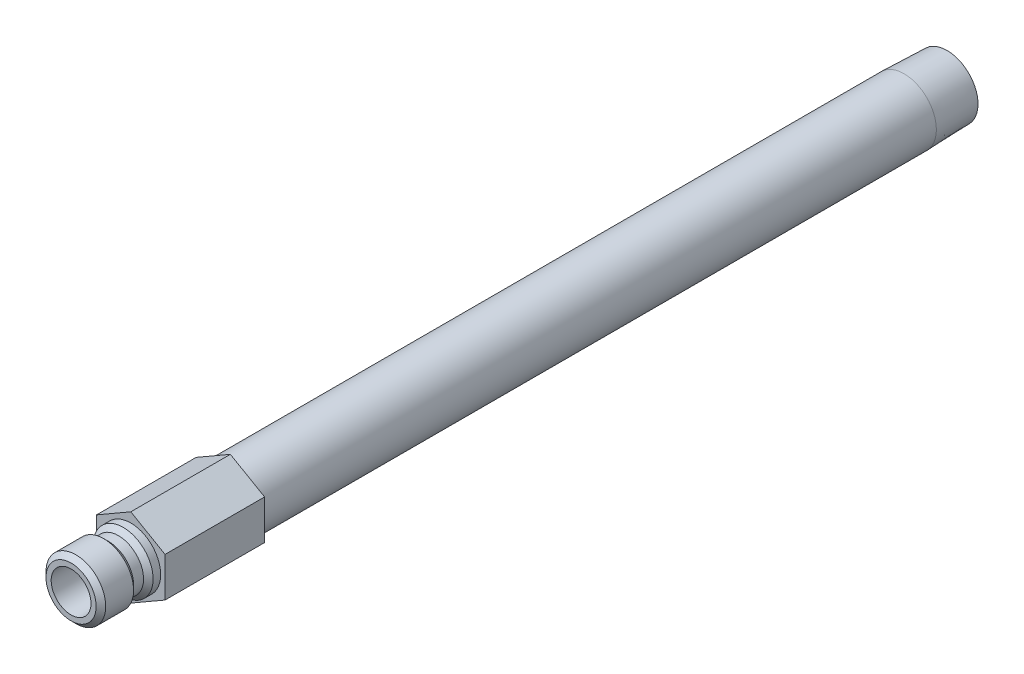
ISO-10303-21;
HEADER;
FILE_DESCRIPTION(('STEP AP214'),'2;1');
FILE_NAME('part.step','',(''),(''),'','','');
FILE_SCHEMA(('AUTOMOTIVE_DESIGN { 1 0 10303 214 1 1 1 1 }'));
ENDSEC;
DATA;
#1=APPLICATION_CONTEXT('core data for automotive mechanical design processes');
#2=APPLICATION_PROTOCOL_DEFINITION('international standard','automotive_design',2000,#1);
#3=PRODUCT_CONTEXT('',#1,'mechanical');
#4=PRODUCT('Part','Part','',(#3));
#5=PRODUCT_RELATED_PRODUCT_CATEGORY('part','',(#4));
#6=PRODUCT_DEFINITION_FORMATION('','',#4);
#7=PRODUCT_DEFINITION_CONTEXT('part definition',#1,'design');
#8=PRODUCT_DEFINITION('design','',#6,#7);
#9=PRODUCT_DEFINITION_SHAPE('','',#8);
#10=(LENGTH_UNIT() NAMED_UNIT(*) SI_UNIT(.MILLI.,.METRE.));
#11=(NAMED_UNIT(*) PLANE_ANGLE_UNIT() SI_UNIT($,.RADIAN.));
#12=(NAMED_UNIT(*) SI_UNIT($,.STERADIAN.) SOLID_ANGLE_UNIT());
#13=UNCERTAINTY_MEASURE_WITH_UNIT(LENGTH_MEASURE(1.E-05),#10,'distance_accuracy_value','');
#14=(GEOMETRIC_REPRESENTATION_CONTEXT(3) GLOBAL_UNCERTAINTY_ASSIGNED_CONTEXT((#13)) GLOBAL_UNIT_ASSIGNED_CONTEXT((#10,
#11,#12)) REPRESENTATION_CONTEXT('',''));
#15=CARTESIAN_POINT('',(0.,0.,0.));
#16=DIRECTION('',(0.,0.,1.));
#17=DIRECTION('',(1.,0.,0.));
#18=AXIS2_PLACEMENT_3D('',#15,#16,#17);
#19=CARTESIAN_POINT('',(0.,4.7625,0.));
#20=DIRECTION('',(0.,0.,1.));
#21=DIRECTION('',(0.,-1.,0.));
#22=AXIS2_PLACEMENT_3D('',#19,#20,#21);
#23=PLANE('',#22);
#24=CARTESIAN_POINT('',(0.,0.,0.));
#25=DIRECTION('',(0.,0.,-1.));
#26=DIRECTION('',(0.,1.,0.));
#27=AXIS2_PLACEMENT_3D('',#24,#25,#26);
#28=CIRCLE('',#27,4.7625);
#29=CARTESIAN_POINT('',(0.,4.7625,0.));
#30=VERTEX_POINT('',#29);
#31=EDGE_CURVE('E166',#30,#30,#28,.T.);
#32=ORIENTED_EDGE('',*,*,#31,.T.);
#33=EDGE_LOOP('',(#32));
#34=FACE_BOUND('',#33,.T.);
#35=DIRECTION('',(-0.866025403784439,-0.5,0.));
#36=VECTOR('',#35,1.);
#37=CARTESIAN_POINT('',(0.,6.3058196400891,0.));
#38=LINE('',#37,#36);
#39=CARTESIAN_POINT('',(0.,6.3058196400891,0.));
#40=VERTEX_POINT('',#39);
#41=CARTESIAN_POINT('',(-5.461,3.15290982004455,0.));
#42=VERTEX_POINT('',#41);
#43=EDGE_CURVE('E122',#40,#42,#38,.T.);
#44=ORIENTED_EDGE('',*,*,#43,.T.);
#45=DIRECTION('',(0.,-1.,0.));
#46=VECTOR('',#45,1.);
#47=CARTESIAN_POINT('',(-5.461,3.15290982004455,0.));
#48=LINE('',#47,#46);
#49=CARTESIAN_POINT('',(-5.461,-3.15290982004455,0.));
#50=VERTEX_POINT('',#49);
#51=EDGE_CURVE('E125',#42,#50,#48,.T.);
#52=ORIENTED_EDGE('',*,*,#51,.T.);
#53=DIRECTION('',(0.866025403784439,-0.5,0.));
#54=VECTOR('',#53,1.);
#55=CARTESIAN_POINT('',(-5.461,-3.15290982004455,0.));
#56=LINE('',#55,#54);
#57=CARTESIAN_POINT('',(0.,-6.30581964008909,0.));
#58=VERTEX_POINT('',#57);
#59=EDGE_CURVE('E129',#50,#58,#56,.T.);
#60=ORIENTED_EDGE('',*,*,#59,.T.);
#61=DIRECTION('',(0.866025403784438,0.5,0.));
#62=VECTOR('',#61,1.);
#63=CARTESIAN_POINT('',(0.,-6.30581964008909,0.));
#64=LINE('',#63,#62);
#65=CARTESIAN_POINT('',(5.461,-3.15290982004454,0.));
#66=VERTEX_POINT('',#65);
#67=EDGE_CURVE('E132',#58,#66,#64,.T.);
#68=ORIENTED_EDGE('',*,*,#67,.T.);
#69=DIRECTION('',(0.,1.,0.));
#70=VECTOR('',#69,1.);
#71=CARTESIAN_POINT('',(5.461,-3.15290982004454,0.));
#72=LINE('',#71,#70);
#73=CARTESIAN_POINT('',(5.461,3.15290982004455,0.));
#74=VERTEX_POINT('',#73);
#75=EDGE_CURVE('E99',#66,#74,#72,.T.);
#76=ORIENTED_EDGE('',*,*,#75,.T.);
#77=DIRECTION('',(-0.866025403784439,0.5,0.));
#78=VECTOR('',#77,1.);
#79=CARTESIAN_POINT('',(5.461,3.15290982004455,0.));
#80=LINE('',#79,#78);
#81=EDGE_CURVE('E135',#74,#40,#80,.T.);
#82=ORIENTED_EDGE('',*,*,#81,.T.);
#83=EDGE_LOOP('',(#44,#52,#60,#68,#76,#82));
#84=FACE_BOUND('',#83,.T.);
#85=ADVANCED_FACE('F33',(#34,#84),#23,.T.);
#86=CARTESIAN_POINT('',(0.,0.,0.));
#87=DIRECTION('',(0.,0.,-1.));
#88=DIRECTION('',(0.,1.,0.));
#89=AXIS2_PLACEMENT_3D('',#86,#87,#88);
#90=CYLINDRICAL_SURFACE('',#89,4.7625);
#91=CARTESIAN_POINT('',(0.,0.,1.2065));
#92=DIRECTION('',(0.,0.,-1.));
#93=DIRECTION('',(0.,1.,0.));
#94=AXIS2_PLACEMENT_3D('',#91,#92,#93);
#95=CIRCLE('',#94,4.7625);
#96=CARTESIAN_POINT('',(0.,4.7625,1.2065));
#97=VERTEX_POINT('',#96);
#98=EDGE_CURVE('E163',#97,#97,#95,.T.);
#99=ORIENTED_EDGE('',*,*,#98,.T.);
#100=EDGE_LOOP('',(#99));
#101=FACE_BOUND('',#100,.T.);
#102=ORIENTED_EDGE('',*,*,#31,.F.);
#103=EDGE_LOOP('',(#102));
#104=FACE_BOUND('',#103,.T.);
#105=ADVANCED_FACE('F192',(#101,#104),#90,.T.);
#106=CARTESIAN_POINT('',(0.,0.,1.2065));
#107=DIRECTION('',(0.,0.,-1.));
#108=DIRECTION('',(0.,1.,0.));
#109=AXIS2_PLACEMENT_3D('',#106,#107,#108);
#110=CONICAL_SURFACE('',#109,4.7625,0.785398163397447);
#111=CARTESIAN_POINT('',(0.,0.,1.9685));
#112=DIRECTION('',(0.,0.,-1.));
#113=DIRECTION('',(0.,1.,0.));
#114=AXIS2_PLACEMENT_3D('',#111,#112,#113);
#115=CIRCLE('',#114,4.0005);
#116=CARTESIAN_POINT('',(0.,4.0005,1.9685));
#117=VERTEX_POINT('',#116);
#118=EDGE_CURVE('E160',#117,#117,#115,.T.);
#119=ORIENTED_EDGE('',*,*,#118,.T.);
#120=EDGE_LOOP('',(#119));
#121=FACE_BOUND('',#120,.T.);
#122=ORIENTED_EDGE('',*,*,#98,.F.);
#123=EDGE_LOOP('',(#122));
#124=FACE_BOUND('',#123,.T.);
#125=ADVANCED_FACE('F198',(#121,#124),#110,.T.);
#126=CARTESIAN_POINT('',(0.,0.,0.));
#127=DIRECTION('',(0.,0.,-1.));
#128=DIRECTION('',(0.,1.,0.));
#129=AXIS2_PLACEMENT_3D('',#126,#127,#128);
#130=CYLINDRICAL_SURFACE('',#129,4.0005);
#131=CARTESIAN_POINT('',(0.,0.,3.556));
#132=DIRECTION('',(0.,0.,-1.));
#133=DIRECTION('',(0.,1.,0.));
#134=AXIS2_PLACEMENT_3D('',#131,#132,#133);
#135=CIRCLE('',#134,4.0005);
#136=CARTESIAN_POINT('',(0.,4.0005,3.556));
#137=VERTEX_POINT('',#136);
#138=EDGE_CURVE('E157',#137,#137,#135,.T.);
#139=ORIENTED_EDGE('',*,*,#138,.T.);
#140=EDGE_LOOP('',(#139));
#141=FACE_BOUND('',#140,.T.);
#142=ORIENTED_EDGE('',*,*,#118,.F.);
#143=EDGE_LOOP('',(#142));
#144=FACE_BOUND('',#143,.T.);
#145=ADVANCED_FACE('F258',(#141,#144),#130,.T.);
#146=CARTESIAN_POINT('',(0.,0.,3.556));
#147=DIRECTION('',(0.,0.,1.));
#148=DIRECTION('',(0.,-1.,0.));
#149=AXIS2_PLACEMENT_3D('',#146,#147,#148);
#150=CONICAL_SURFACE('',#149,4.0005,0.785398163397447);
#151=CARTESIAN_POINT('',(0.,0.,4.318));
#152=DIRECTION('',(0.,0.,-1.));
#153=DIRECTION('',(0.,1.,0.));
#154=AXIS2_PLACEMENT_3D('',#151,#152,#153);
#155=CIRCLE('',#154,4.7625);
#156=CARTESIAN_POINT('',(0.,4.7625,4.318));
#157=VERTEX_POINT('',#156);
#158=EDGE_CURVE('E154',#157,#157,#155,.T.);
#159=ORIENTED_EDGE('',*,*,#158,.T.);
#160=EDGE_LOOP('',(#159));
#161=FACE_BOUND('',#160,.T.);
#162=ORIENTED_EDGE('',*,*,#138,.F.);
#163=EDGE_LOOP('',(#162));
#164=FACE_BOUND('',#163,.T.);
#165=ADVANCED_FACE('F254',(#161,#164),#150,.T.);
#166=CARTESIAN_POINT('',(0.,0.,0.));
#167=DIRECTION('',(0.,0.,-1.));
#168=DIRECTION('',(0.,1.,0.));
#169=AXIS2_PLACEMENT_3D('',#166,#167,#168);
#170=CYLINDRICAL_SURFACE('',#169,4.7625);
#171=CARTESIAN_POINT('',(0.,0.,8.763));
#172=DIRECTION('',(0.,0.,-1.));
#173=DIRECTION('',(0.,1.,0.));
#174=AXIS2_PLACEMENT_3D('',#171,#172,#173);
#175=CIRCLE('',#174,4.7625);
#176=CARTESIAN_POINT('',(0.,4.7625,8.763));
#177=VERTEX_POINT('',#176);
#178=EDGE_CURVE('E151',#177,#177,#175,.T.);
#179=ORIENTED_EDGE('',*,*,#178,.T.);
#180=EDGE_LOOP('',(#179));
#181=FACE_BOUND('',#180,.T.);
#182=ORIENTED_EDGE('',*,*,#158,.F.);
#183=EDGE_LOOP('',(#182));
#184=FACE_BOUND('',#183,.T.);
#185=ADVANCED_FACE('F250',(#181,#184),#170,.T.);
#186=CARTESIAN_POINT('',(0.,0.,8.763));
#187=DIRECTION('',(0.,0.,-1.));
#188=DIRECTION('',(0.,1.,0.));
#189=AXIS2_PLACEMENT_3D('',#186,#187,#188);
#190=CONICAL_SURFACE('',#189,4.7625,0.785398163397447);
#191=CARTESIAN_POINT('',(0.,0.,9.525));
#192=DIRECTION('',(0.,0.,-1.));
#193=DIRECTION('',(0.,1.,0.));
#194=AXIS2_PLACEMENT_3D('',#191,#192,#193);
#195=CIRCLE('',#194,4.0005);
#196=CARTESIAN_POINT('',(0.,4.0005,9.525));
#197=VERTEX_POINT('',#196);
#198=EDGE_CURVE('E148',#197,#197,#195,.T.);
#199=ORIENTED_EDGE('',*,*,#198,.T.);
#200=EDGE_LOOP('',(#199));
#201=FACE_BOUND('',#200,.T.);
#202=ORIENTED_EDGE('',*,*,#178,.F.);
#203=EDGE_LOOP('',(#202));
#204=FACE_BOUND('',#203,.T.);
#205=ADVANCED_FACE('F246',(#201,#204),#190,.T.);
#206=CARTESIAN_POINT('',(0.,3.175,9.525));
#207=DIRECTION('',(0.,0.,1.));
#208=DIRECTION('',(0.,-1.,0.));
#209=AXIS2_PLACEMENT_3D('',#206,#207,#208);
#210=PLANE('',#209);
#211=CARTESIAN_POINT('',(0.,0.,9.525));
#212=DIRECTION('',(0.,0.,-1.));
#213=DIRECTION('',(0.,1.,0.));
#214=AXIS2_PLACEMENT_3D('',#211,#212,#213);
#215=CIRCLE('',#214,3.175);
#216=CARTESIAN_POINT('',(0.,3.175,9.525));
#217=VERTEX_POINT('',#216);
#218=EDGE_CURVE('E145',#217,#217,#215,.T.);
#219=ORIENTED_EDGE('',*,*,#218,.T.);
#220=EDGE_LOOP('',(#219));
#221=FACE_BOUND('',#220,.T.);
#222=ORIENTED_EDGE('',*,*,#198,.F.);
#223=EDGE_LOOP('',(#222));
#224=FACE_BOUND('',#223,.T.);
#225=ADVANCED_FACE('F242',(#221,#224),#210,.T.);
#226=CARTESIAN_POINT('',(0.,0.,0.));
#227=DIRECTION('',(0.,0.,-1.));
#228=DIRECTION('',(0.,1.,0.));
#229=AXIS2_PLACEMENT_3D('',#226,#227,#228);
#230=CYLINDRICAL_SURFACE('',#229,3.175);
#231=CARTESIAN_POINT('',(0.,0.,0.));
#232=DIRECTION('',(0.,0.,1.));
#233=DIRECTION('',(1.,0.,0.));
#234=AXIS2_PLACEMENT_3D('',#231,#232,#233);
#235=CIRCLE('',#234,3.175);
#236=CARTESIAN_POINT('',(3.175,0.,0.));
#237=VERTEX_POINT('',#236);
#238=EDGE_CURVE('E11',#237,#237,#235,.T.);
#239=ORIENTED_EDGE('',*,*,#238,.F.);
#240=EDGE_LOOP('',(#239));
#241=FACE_BOUND('',#240,.T.);
#242=ORIENTED_EDGE('',*,*,#218,.F.);
#243=EDGE_LOOP('',(#242));
#244=FACE_BOUND('',#243,.T.);
#245=ADVANCED_FACE('F226',(#241,#244),#230,.F.);
#246=CARTESIAN_POINT('',(-5.461,3.15290982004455,0.));
#247=DIRECTION('',(0.,0.,1.));
#248=DIRECTION('',(1.,0.,0.));
#249=AXIS2_PLACEMENT_3D('',#246,#247,#248);
#250=PLANE('',#249);
#251=ORIENTED_EDGE('',*,*,#238,.T.);
#252=EDGE_LOOP('',(#251));
#253=FACE_BOUND('',#252,.T.);
#254=CARTESIAN_POINT('',(0.,0.,0.));
#255=DIRECTION('',(0.,0.,1.));
#256=DIRECTION('',(1.,0.,0.));
#257=AXIS2_PLACEMENT_3D('',#254,#255,#256);
#258=CIRCLE('',#257,2.38124999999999);
#259=CARTESIAN_POINT('',(2.38124999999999,0.,0.));
#260=VERTEX_POINT('',#259);
#261=EDGE_CURVE('E126',#260,#260,#258,.T.);
#262=ORIENTED_EDGE('',*,*,#261,.F.);
#263=EDGE_LOOP('',(#262));
#264=FACE_BOUND('',#263,.T.);
#265=ADVANCED_FACE('F222',(#253,#264),#250,.T.);
#266=CARTESIAN_POINT('',(0.,6.3058196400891,-15.875));
#267=DIRECTION('',(-0.5,0.866025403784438,0.));
#268=DIRECTION('',(-0.866025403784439,-0.5,0.));
#269=AXIS2_PLACEMENT_3D('',#266,#267,#268);
#270=PLANE('',#269);
#271=ORIENTED_EDGE('',*,*,#43,.F.);
#272=DIRECTION('',(0.,0.,1.));
#273=VECTOR('',#272,1.);
#274=CARTESIAN_POINT('',(0.,6.3058196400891,-15.875));
#275=LINE('',#274,#273);
#276=CARTESIAN_POINT('',(0.,6.3058196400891,-15.875));
#277=VERTEX_POINT('',#276);
#278=EDGE_CURVE('E51',#277,#40,#275,.T.);
#279=ORIENTED_EDGE('',*,*,#278,.F.);
#280=DIRECTION('',(-0.866025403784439,-0.5,0.));
#281=VECTOR('',#280,1.);
#282=CARTESIAN_POINT('',(0.,6.3058196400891,-15.875));
#283=LINE('',#282,#281);
#284=CARTESIAN_POINT('',(-5.461,3.15290982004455,-15.875));
#285=VERTEX_POINT('',#284);
#286=EDGE_CURVE('E138',#277,#285,#283,.T.);
#287=ORIENTED_EDGE('',*,*,#286,.T.);
#288=DIRECTION('',(0.,0.,1.));
#289=VECTOR('',#288,1.);
#290=CARTESIAN_POINT('',(-5.461,3.15290982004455,-15.875));
#291=LINE('',#290,#289);
#292=EDGE_CURVE('E86',#285,#42,#291,.T.);
#293=ORIENTED_EDGE('',*,*,#292,.T.);
#294=EDGE_LOOP('',(#271,#279,#287,#293));
#295=FACE_BOUND('',#294,.T.);
#296=ADVANCED_FACE('F225',(#295),#270,.T.);
#297=CARTESIAN_POINT('',(5.461,3.15290982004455,-15.875));
#298=DIRECTION('',(0.5,0.866025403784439,0.));
#299=DIRECTION('',(-0.866025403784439,0.5,0.));
#300=AXIS2_PLACEMENT_3D('',#297,#298,#299);
#301=PLANE('',#300);
#302=ORIENTED_EDGE('',*,*,#81,.F.);
#303=DIRECTION('',(0.,0.,1.));
#304=VECTOR('',#303,1.);
#305=CARTESIAN_POINT('',(5.461,3.15290982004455,-15.875));
#306=LINE('',#305,#304);
#307=CARTESIAN_POINT('',(5.461,3.15290982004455,-15.875));
#308=VERTEX_POINT('',#307);
#309=EDGE_CURVE('E74',#308,#74,#306,.T.);
#310=ORIENTED_EDGE('',*,*,#309,.F.);
#311=DIRECTION('',(-0.866025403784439,0.5,0.));
#312=VECTOR('',#311,1.);
#313=CARTESIAN_POINT('',(5.461,3.15290982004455,-15.875));
#314=LINE('',#313,#312);
#315=EDGE_CURVE('E112',#308,#277,#314,.T.);
#316=ORIENTED_EDGE('',*,*,#315,.T.);
#317=ORIENTED_EDGE('',*,*,#278,.T.);
#318=EDGE_LOOP('',(#302,#310,#316,#317));
#319=FACE_BOUND('',#318,.T.);
#320=ADVANCED_FACE('F228',(#319),#301,.T.);
#321=CARTESIAN_POINT('',(5.461,-3.15290982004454,-15.875));
#322=DIRECTION('',(1.,0.,0.));
#323=DIRECTION('',(0.,1.,0.));
#324=AXIS2_PLACEMENT_3D('',#321,#322,#323);
#325=PLANE('',#324);
#326=ORIENTED_EDGE('',*,*,#75,.F.);
#327=DIRECTION('',(0.,0.,1.));
#328=VECTOR('',#327,1.);
#329=CARTESIAN_POINT('',(5.461,-3.15290982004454,-15.875));
#330=LINE('',#329,#328);
#331=CARTESIAN_POINT('',(5.461,-3.15290982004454,-15.875));
#332=VERTEX_POINT('',#331);
#333=EDGE_CURVE('E94',#332,#66,#330,.T.);
#334=ORIENTED_EDGE('',*,*,#333,.F.);
#335=DIRECTION('',(0.,1.,0.));
#336=VECTOR('',#335,1.);
#337=CARTESIAN_POINT('',(5.461,-3.15290982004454,-15.875));
#338=LINE('',#337,#336);
#339=EDGE_CURVE('E97',#332,#308,#338,.T.);
#340=ORIENTED_EDGE('',*,*,#339,.T.);
#341=ORIENTED_EDGE('',*,*,#309,.T.);
#342=EDGE_LOOP('',(#326,#334,#340,#341));
#343=FACE_BOUND('',#342,.T.);
#344=ADVANCED_FACE('F96',(#343),#325,.T.);
#345=CARTESIAN_POINT('',(0.,-6.30581964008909,-15.875));
#346=DIRECTION('',(0.5,-0.866025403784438,0.));
#347=DIRECTION('',(0.866025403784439,0.5,0.));
#348=AXIS2_PLACEMENT_3D('',#345,#346,#347);
#349=PLANE('',#348);
#350=ORIENTED_EDGE('',*,*,#67,.F.);
#351=DIRECTION('',(0.,0.,1.));
#352=VECTOR('',#351,1.);
#353=CARTESIAN_POINT('',(0.,-6.30581964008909,-15.875));
#354=LINE('',#353,#352);
#355=CARTESIAN_POINT('',(0.,-6.30581964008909,-15.875));
#356=VERTEX_POINT('',#355);
#357=EDGE_CURVE('E104',#356,#58,#354,.T.);
#358=ORIENTED_EDGE('',*,*,#357,.F.);
#359=DIRECTION('',(0.866025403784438,0.5,0.));
#360=VECTOR('',#359,1.);
#361=CARTESIAN_POINT('',(0.,-6.30581964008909,-15.875));
#362=LINE('',#361,#360);
#363=EDGE_CURVE('E110',#356,#332,#362,.T.);
#364=ORIENTED_EDGE('',*,*,#363,.T.);
#365=ORIENTED_EDGE('',*,*,#333,.T.);
#366=EDGE_LOOP('',(#350,#358,#364,#365));
#367=FACE_BOUND('',#366,.T.);
#368=ADVANCED_FACE('F114',(#367),#349,.T.);
#369=CARTESIAN_POINT('',(-5.461,-3.15290982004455,-15.875));
#370=DIRECTION('',(-0.5,-0.866025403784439,0.));
#371=DIRECTION('',(0.866025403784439,-0.5,0.));
#372=AXIS2_PLACEMENT_3D('',#369,#370,#371);
#373=PLANE('',#372);
#374=ORIENTED_EDGE('',*,*,#59,.F.);
#375=DIRECTION('',(0.,0.,1.));
#376=VECTOR('',#375,1.);
#377=CARTESIAN_POINT('',(-5.461,-3.15290982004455,-15.875));
#378=LINE('',#377,#376);
#379=CARTESIAN_POINT('',(-5.461,-3.15290982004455,-15.875));
#380=VERTEX_POINT('',#379);
#381=EDGE_CURVE('E142',#380,#50,#378,.T.);
#382=ORIENTED_EDGE('',*,*,#381,.F.);
#383=DIRECTION('',(0.866025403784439,-0.5,0.));
#384=VECTOR('',#383,1.);
#385=CARTESIAN_POINT('',(-5.461,-3.15290982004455,-15.875));
#386=LINE('',#385,#384);
#387=EDGE_CURVE('E115',#380,#356,#386,.T.);
#388=ORIENTED_EDGE('',*,*,#387,.T.);
#389=ORIENTED_EDGE('',*,*,#357,.T.);
#390=EDGE_LOOP('',(#374,#382,#388,#389));
#391=FACE_BOUND('',#390,.T.);
#392=ADVANCED_FACE('F219',(#391),#373,.T.);
#393=CARTESIAN_POINT('',(-5.461,3.15290982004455,-15.875));
#394=DIRECTION('',(-1.,0.,0.));
#395=DIRECTION('',(0.,0.,1.));
#396=AXIS2_PLACEMENT_3D('',#393,#394,#395);
#397=PLANE('',#396);
#398=ORIENTED_EDGE('',*,*,#51,.F.);
#399=ORIENTED_EDGE('',*,*,#292,.F.);
#400=DIRECTION('',(0.,-1.,0.));
#401=VECTOR('',#400,1.);
#402=CARTESIAN_POINT('',(-5.461,3.15290982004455,-15.875));
#403=LINE('',#402,#401);
#404=EDGE_CURVE('E117',#285,#380,#403,.T.);
#405=ORIENTED_EDGE('',*,*,#404,.T.);
#406=ORIENTED_EDGE('',*,*,#381,.T.);
#407=EDGE_LOOP('',(#398,#399,#405,#406));
#408=FACE_BOUND('',#407,.T.);
#409=ADVANCED_FACE('F214',(#408),#397,.T.);
#410=CARTESIAN_POINT('',(-5.461,3.15290982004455,-15.875));
#411=DIRECTION('',(0.,0.,1.));
#412=DIRECTION('',(1.,0.,0.));
#413=AXIS2_PLACEMENT_3D('',#410,#411,#412);
#414=PLANE('',#413);
#415=CARTESIAN_POINT('',(0.,0.,-15.875));
#416=DIRECTION('',(0.,0.,1.));
#417=DIRECTION('',(1.,0.,0.));
#418=AXIS2_PLACEMENT_3D('',#415,#416,#417);
#419=CIRCLE('',#418,5.14349999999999);
#420=CARTESIAN_POINT('',(5.14349999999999,0.,-15.875));
#421=VERTEX_POINT('',#420);
#422=EDGE_CURVE('E37',#421,#421,#419,.F.);
#423=ORIENTED_EDGE('',*,*,#422,.F.);
#424=EDGE_LOOP('',(#423));
#425=FACE_BOUND('',#424,.T.);
#426=ORIENTED_EDGE('',*,*,#286,.F.);
#427=ORIENTED_EDGE('',*,*,#315,.F.);
#428=ORIENTED_EDGE('',*,*,#339,.F.);
#429=ORIENTED_EDGE('',*,*,#363,.F.);
#430=ORIENTED_EDGE('',*,*,#387,.F.);
#431=ORIENTED_EDGE('',*,*,#404,.F.);
#432=EDGE_LOOP('',(#426,#427,#428,#429,#430,#431));
#433=FACE_BOUND('',#432,.T.);
#434=ADVANCED_FACE('F108',(#425,#433),#414,.F.);
#435=CARTESIAN_POINT('',(0.,0.,0.));
#436=DIRECTION('',(0.,0.,-1.));
#437=DIRECTION('',(0.,1.,0.));
#438=AXIS2_PLACEMENT_3D('',#435,#436,#437);
#439=CYLINDRICAL_SURFACE('',#438,2.38124999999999);
#440=CARTESIAN_POINT('',(0.,0.,-130.175));
#441=DIRECTION('',(0.,0.,-1.));
#442=DIRECTION('',(0.,1.,0.));
#443=AXIS2_PLACEMENT_3D('',#440,#441,#442);
#444=CIRCLE('',#443,2.38124999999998);
#445=CARTESIAN_POINT('',(0.,2.38125,-130.175));
#446=VERTEX_POINT('',#445);
#447=EDGE_CURVE('E43',#446,#446,#444,.T.);
#448=ORIENTED_EDGE('',*,*,#447,.T.);
#449=EDGE_LOOP('',(#448));
#450=FACE_BOUND('',#449,.T.);
#451=ORIENTED_EDGE('',*,*,#261,.T.);
#452=EDGE_LOOP('',(#451));
#453=FACE_BOUND('',#452,.T.);
#454=ADVANCED_FACE('F35',(#450,#453),#439,.F.);
#455=CARTESIAN_POINT('',(0.,4.9291887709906,-130.175));
#456=DIRECTION('',(0.,0.,-1.));
#457=DIRECTION('',(0.,1.,0.));
#458=AXIS2_PLACEMENT_3D('',#455,#456,#457);
#459=PLANE('',#458);
#460=CARTESIAN_POINT('',(0.,0.,-130.175));
#461=DIRECTION('',(0.,0.,-1.));
#462=DIRECTION('',(0.,1.,0.));
#463=AXIS2_PLACEMENT_3D('',#460,#461,#462);
#464=CIRCLE('',#463,4.92918877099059);
#465=CARTESIAN_POINT('',(0.,4.9291887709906,-130.175));
#466=VERTEX_POINT('',#465);
#467=EDGE_CURVE('E172',#466,#466,#464,.T.);
#468=ORIENTED_EDGE('',*,*,#467,.T.);
#469=EDGE_LOOP('',(#468));
#470=FACE_BOUND('',#469,.T.);
#471=ORIENTED_EDGE('',*,*,#447,.F.);
#472=EDGE_LOOP('',(#471));
#473=FACE_BOUND('',#472,.T.);
#474=ADVANCED_FACE('F180',(#470,#473),#459,.T.);
#475=CARTESIAN_POINT('',(0.,0.,-130.175));
#476=DIRECTION('',(0.,0.,1.));
#477=DIRECTION('',(0.,-1.,0.));
#478=AXIS2_PLACEMENT_3D('',#475,#476,#477);
#479=CONICAL_SURFACE('',#478,4.92918877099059,0.0312396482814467);
#480=CARTESIAN_POINT('',(0.,0.,-123.317));
#481=DIRECTION('',(0.,0.,-1.));
#482=DIRECTION('',(0.,1.,0.));
#483=AXIS2_PLACEMENT_3D('',#480,#481,#482);
#484=CIRCLE('',#483,5.14349999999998);
#485=CARTESIAN_POINT('',(0.,5.1435,-123.317));
#486=VERTEX_POINT('',#485);
#487=EDGE_CURVE('E169',#486,#486,#484,.T.);
#488=ORIENTED_EDGE('',*,*,#487,.T.);
#489=EDGE_LOOP('',(#488));
#490=FACE_BOUND('',#489,.T.);
#491=ORIENTED_EDGE('',*,*,#467,.F.);
#492=EDGE_LOOP('',(#491));
#493=FACE_BOUND('',#492,.T.);
#494=ADVANCED_FACE('F182',(#490,#493),#479,.T.);
#495=CARTESIAN_POINT('',(0.,0.,0.));
#496=DIRECTION('',(0.,0.,-1.));
#497=DIRECTION('',(0.,1.,0.));
#498=AXIS2_PLACEMENT_3D('',#495,#496,#497);
#499=CYLINDRICAL_SURFACE('',#498,5.14349999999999);
#500=ORIENTED_EDGE('',*,*,#487,.F.);
#501=EDGE_LOOP('',(#500));
#502=FACE_BOUND('',#501,.T.);
#503=ORIENTED_EDGE('',*,*,#422,.T.);
#504=EDGE_LOOP('',(#503));
#505=FACE_BOUND('',#504,.T.);
#506=ADVANCED_FACE('F188',(#502,#505),#499,.T.);
#507=CLOSED_SHELL('',(#85,#105,#125,#145,#165,#185,#205,#225,#245,#265,#296,#320,#344,#368,#392,
#409,#434,#454,#474,#494,#506));
#508=MANIFOLD_SOLID_BREP('B2',#507);
#509=ADVANCED_BREP_SHAPE_REPRESENTATION('',(#18,#508),#14);
#510=SHAPE_DEFINITION_REPRESENTATION(#9,#509);
ENDSEC;
END-ISO-10303-21;
